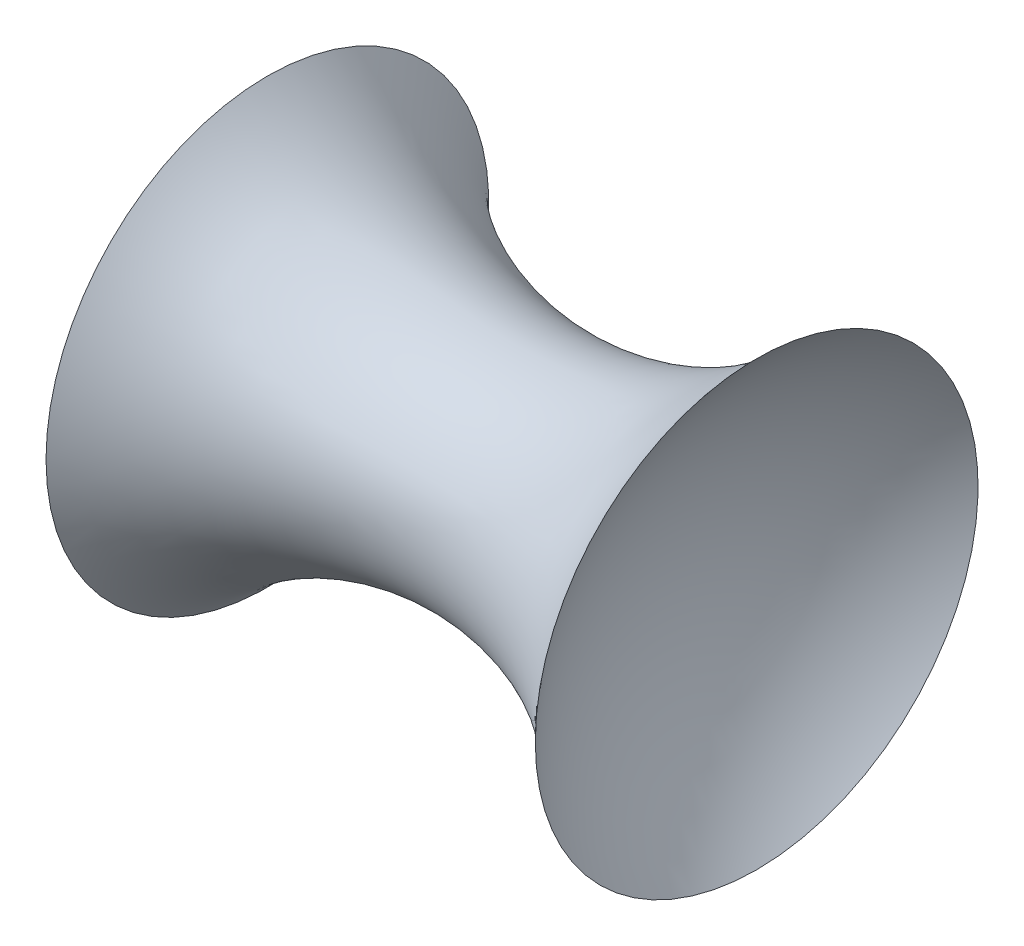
from build123d import *


with BuildPart() as part:
    # Skizze1 → Rotation1 (revolve)
    with BuildSketch(Plane.XY, mode=Mode.PRIVATE) as rotation1_sk:
        with BuildLine():
            Line((29.48518774, 0), (15, 0))
            ThreePointArc((15, 0), (13.996775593, -5.393539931), (11.121296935, -10.065622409))
            ThreePointArc((11.121296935, -10.065622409), (22.24259387, -5.131244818), (33.363890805, -10.065622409))
            ThreePointArc((33.363890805, -10.065622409), (30.488412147, -5.393539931), (29.48518774, 0))
        make_face()
    revolve(rotation1_sk.sketch.rotate(Axis((0, 0, 0), (1, 0, 0)), 270), axis=Axis((0, 0, 0), (1, 0, 0)))


solid = part.part
